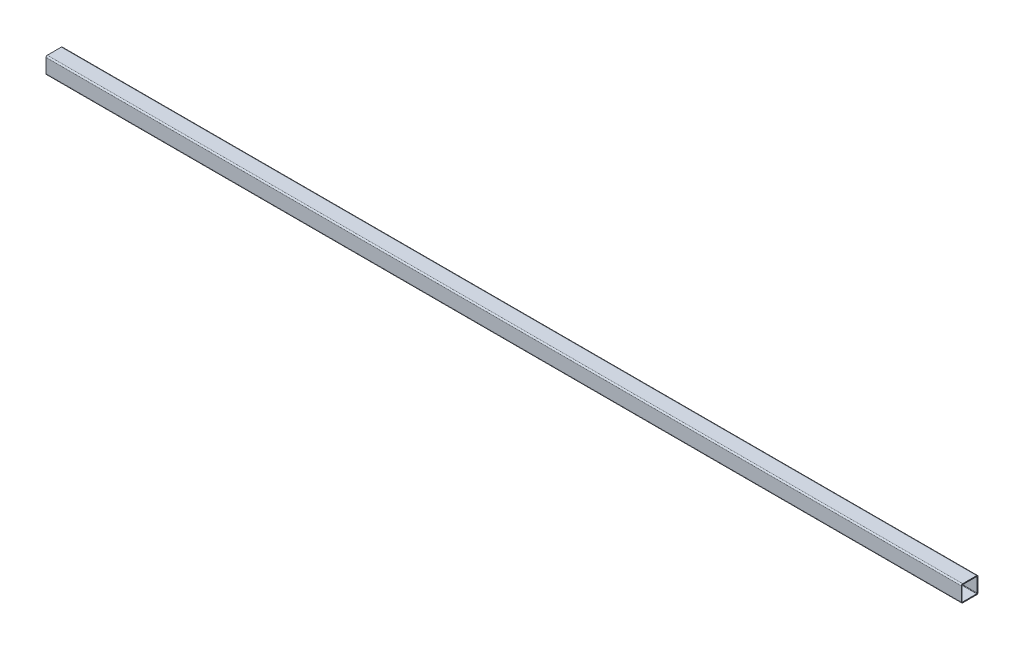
ISO-10303-21;
HEADER;
FILE_DESCRIPTION(('STEP AP214'),'2;1');
FILE_NAME('part.step','',(''),(''),'','','');
FILE_SCHEMA(('AUTOMOTIVE_DESIGN { 1 0 10303 214 1 1 1 1 }'));
ENDSEC;
DATA;
#1=APPLICATION_CONTEXT('core data for automotive mechanical design processes');
#2=APPLICATION_PROTOCOL_DEFINITION('international standard','automotive_design',2000,#1);
#3=PRODUCT_CONTEXT('',#1,'mechanical');
#4=PRODUCT('Part','Part','',(#3));
#5=PRODUCT_RELATED_PRODUCT_CATEGORY('part','',(#4));
#6=PRODUCT_DEFINITION_FORMATION('','',#4);
#7=PRODUCT_DEFINITION_CONTEXT('part definition',#1,'design');
#8=PRODUCT_DEFINITION('design','',#6,#7);
#9=PRODUCT_DEFINITION_SHAPE('','',#8);
#10=(LENGTH_UNIT() NAMED_UNIT(*) SI_UNIT(.MILLI.,.METRE.));
#11=(NAMED_UNIT(*) PLANE_ANGLE_UNIT() SI_UNIT($,.RADIAN.));
#12=(NAMED_UNIT(*) SI_UNIT($,.STERADIAN.) SOLID_ANGLE_UNIT());
#13=UNCERTAINTY_MEASURE_WITH_UNIT(LENGTH_MEASURE(1.E-05),#10,'distance_accuracy_value','');
#14=(GEOMETRIC_REPRESENTATION_CONTEXT(3) GLOBAL_UNCERTAINTY_ASSIGNED_CONTEXT((#13)) GLOBAL_UNIT_ASSIGNED_CONTEXT((#10,
#11,#12)) REPRESENTATION_CONTEXT('',''));
#15=CARTESIAN_POINT('',(0.,0.,0.));
#16=DIRECTION('',(0.,0.,1.));
#17=DIRECTION('',(1.,0.,0.));
#18=AXIS2_PLACEMENT_3D('',#15,#16,#17);
#19=CARTESIAN_POINT('',(698.5,10.541,21.209));
#20=DIRECTION('',(1.,0.,0.));
#21=DIRECTION('',(0.,0.,-1.));
#22=AXIS2_PLACEMENT_3D('',#19,#20,#21);
#23=PLANE('',#22);
#24=CARTESIAN_POINT('',(698.5,10.541,21.209));
#25=DIRECTION('',(1.,0.,0.));
#26=DIRECTION('',(0.,0.,-1.));
#27=AXIS2_PLACEMENT_3D('',#24,#25,#26);
#28=CIRCLE('',#27,1.016);
#29=CARTESIAN_POINT('',(698.5,10.541,22.225));
#30=VERTEX_POINT('',#29);
#31=CARTESIAN_POINT('',(698.5,9.525,21.209));
#32=VERTEX_POINT('',#31);
#33=EDGE_CURVE('E262',#30,#32,#28,.T.);
#34=ORIENTED_EDGE('',*,*,#33,.T.);
#35=DIRECTION('',(0.,0.,-1.));
#36=VECTOR('',#35,1.);
#37=CARTESIAN_POINT('',(698.5,9.525,21.209));
#38=LINE('',#37,#36);
#39=CARTESIAN_POINT('',(698.5,9.525,10.541));
#40=VERTEX_POINT('',#39);
#41=EDGE_CURVE('E476',#32,#40,#38,.T.);
#42=ORIENTED_EDGE('',*,*,#41,.T.);
#43=CARTESIAN_POINT('',(698.5,10.541,10.541));
#44=DIRECTION('',(1.,0.,0.));
#45=DIRECTION('',(0.,0.,-1.));
#46=AXIS2_PLACEMENT_3D('',#43,#44,#45);
#47=CIRCLE('',#46,1.016);
#48=CARTESIAN_POINT('',(698.5,10.541,9.52499999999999));
#49=VERTEX_POINT('',#48);
#50=EDGE_CURVE('E163',#40,#49,#47,.T.);
#51=ORIENTED_EDGE('',*,*,#50,.T.);
#52=DIRECTION('',(0.,1.,0.));
#53=VECTOR('',#52,1.);
#54=CARTESIAN_POINT('',(698.5,10.541,9.52499999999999));
#55=LINE('',#54,#53);
#56=CARTESIAN_POINT('',(698.5,21.209,9.52499999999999));
#57=VERTEX_POINT('',#56);
#58=EDGE_CURVE('E462',#49,#57,#55,.T.);
#59=ORIENTED_EDGE('',*,*,#58,.T.);
#60=CARTESIAN_POINT('',(698.5,21.209,10.541));
#61=DIRECTION('',(1.,0.,0.));
#62=DIRECTION('',(0.,0.,-1.));
#63=AXIS2_PLACEMENT_3D('',#60,#61,#62);
#64=CIRCLE('',#63,1.016);
#65=CARTESIAN_POINT('',(698.5,22.225,10.541));
#66=VERTEX_POINT('',#65);
#67=EDGE_CURVE('E471',#57,#66,#64,.T.);
#68=ORIENTED_EDGE('',*,*,#67,.T.);
#69=DIRECTION('',(0.,0.,1.));
#70=VECTOR('',#69,1.);
#71=CARTESIAN_POINT('',(698.5,22.225,10.541));
#72=LINE('',#71,#70);
#73=CARTESIAN_POINT('',(698.5,22.225,21.209));
#74=VERTEX_POINT('',#73);
#75=EDGE_CURVE('E278',#66,#74,#72,.T.);
#76=ORIENTED_EDGE('',*,*,#75,.T.);
#77=CARTESIAN_POINT('',(698.5,21.209,21.209));
#78=DIRECTION('',(1.,0.,0.));
#79=DIRECTION('',(0.,0.,-1.));
#80=AXIS2_PLACEMENT_3D('',#77,#78,#79);
#81=CIRCLE('',#80,1.01600000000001);
#82=CARTESIAN_POINT('',(698.5,21.209,22.225));
#83=VERTEX_POINT('',#82);
#84=EDGE_CURVE('E295',#74,#83,#81,.T.);
#85=ORIENTED_EDGE('',*,*,#84,.T.);
#86=DIRECTION('',(0.,-1.,0.));
#87=VECTOR('',#86,1.);
#88=CARTESIAN_POINT('',(698.5,21.209,22.225));
#89=LINE('',#88,#87);
#90=EDGE_CURVE('E259',#83,#30,#89,.T.);
#91=ORIENTED_EDGE('',*,*,#90,.T.);
#92=EDGE_LOOP('',(#34,#42,#51,#59,#68,#76,#85,#91));
#93=FACE_BOUND('',#92,.T.);
#94=DIRECTION('',(0.,1.,0.));
#95=VECTOR('',#94,1.);
#96=CARTESIAN_POINT('',(698.5,10.541,10.1854));
#97=LINE('',#96,#95);
#98=CARTESIAN_POINT('',(698.5,10.541,10.1854));
#99=VERTEX_POINT('',#98);
#100=CARTESIAN_POINT('',(698.5,21.209,10.1854));
#101=VERTEX_POINT('',#100);
#102=EDGE_CURVE('E255',#99,#101,#97,.T.);
#103=ORIENTED_EDGE('',*,*,#102,.F.);
#104=CARTESIAN_POINT('',(698.5,10.541,10.541));
#105=DIRECTION('',(1.,0.,0.));
#106=DIRECTION('',(0.,0.,-1.));
#107=AXIS2_PLACEMENT_3D('',#104,#105,#106);
#108=CIRCLE('',#107,0.355599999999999);
#109=CARTESIAN_POINT('',(698.5,10.1854,10.541));
#110=VERTEX_POINT('',#109);
#111=EDGE_CURVE('E102',#110,#99,#108,.T.);
#112=ORIENTED_EDGE('',*,*,#111,.F.);
#113=DIRECTION('',(0.,0.,-1.));
#114=VECTOR('',#113,1.);
#115=CARTESIAN_POINT('',(698.5,10.1854,21.209));
#116=LINE('',#115,#114);
#117=CARTESIAN_POINT('',(698.5,10.1854,21.209));
#118=VERTEX_POINT('',#117);
#119=EDGE_CURVE('E214',#118,#110,#116,.T.);
#120=ORIENTED_EDGE('',*,*,#119,.F.);
#121=CARTESIAN_POINT('',(698.5,10.541,21.209));
#122=DIRECTION('',(1.,0.,0.));
#123=DIRECTION('',(0.,0.,-1.));
#124=AXIS2_PLACEMENT_3D('',#121,#122,#123);
#125=CIRCLE('',#124,0.355599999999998);
#126=CARTESIAN_POINT('',(698.5,10.541,21.5646));
#127=VERTEX_POINT('',#126);
#128=EDGE_CURVE('E245',#127,#118,#125,.T.);
#129=ORIENTED_EDGE('',*,*,#128,.F.);
#130=DIRECTION('',(0.,-1.,0.));
#131=VECTOR('',#130,1.);
#132=CARTESIAN_POINT('',(698.5,21.209,21.5646));
#133=LINE('',#132,#131);
#134=CARTESIAN_POINT('',(698.5,21.209,21.5646));
#135=VERTEX_POINT('',#134);
#136=EDGE_CURVE('E231',#135,#127,#133,.T.);
#137=ORIENTED_EDGE('',*,*,#136,.F.);
#138=CARTESIAN_POINT('',(698.5,21.209,21.209));
#139=DIRECTION('',(1.,5.3297785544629E-13,5.3297785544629E-13));
#140=DIRECTION('',(5.3297785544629E-13,0.,-1.));
#141=AXIS2_PLACEMENT_3D('',#138,#139,#140);
#142=CIRCLE('',#141,0.355600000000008);
#143=CARTESIAN_POINT('',(698.5,21.5646,21.209));
#144=VERTEX_POINT('',#143);
#145=EDGE_CURVE('E240',#144,#135,#142,.T.);
#146=ORIENTED_EDGE('',*,*,#145,.F.);
#147=DIRECTION('',(0.,0.,1.));
#148=VECTOR('',#147,1.);
#149=CARTESIAN_POINT('',(698.5,21.5646,10.541));
#150=LINE('',#149,#148);
#151=CARTESIAN_POINT('',(698.5,21.5646,10.541));
#152=VERTEX_POINT('',#151);
#153=EDGE_CURVE('E248',#152,#144,#150,.T.);
#154=ORIENTED_EDGE('',*,*,#153,.F.);
#155=CARTESIAN_POINT('',(698.5,21.209,10.541));
#156=DIRECTION('',(1.,5.32977855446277E-13,-5.32977855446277E-13));
#157=DIRECTION('',(-5.32977855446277E-13,0.,-1.));
#158=AXIS2_PLACEMENT_3D('',#155,#156,#157);
#159=CIRCLE('',#158,0.355599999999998);
#160=EDGE_CURVE('E253',#101,#152,#159,.T.);
#161=ORIENTED_EDGE('',*,*,#160,.F.);
#162=EDGE_LOOP('',(#103,#112,#120,#129,#137,#146,#154,#161));
#163=FACE_BOUND('',#162,.T.);
#164=ADVANCED_FACE('F43',(#93,#163),#23,.T.);
#165=CARTESIAN_POINT('',(0.,10.541,21.209));
#166=DIRECTION('',(1.,0.,0.));
#167=DIRECTION('',(0.,0.,-1.));
#168=AXIS2_PLACEMENT_3D('',#165,#166,#167);
#169=PLANE('',#168);
#170=CARTESIAN_POINT('',(0.,10.541,21.209));
#171=DIRECTION('',(1.,0.,0.));
#172=DIRECTION('',(0.,0.,-1.));
#173=AXIS2_PLACEMENT_3D('',#170,#171,#172);
#174=CIRCLE('',#173,1.016);
#175=CARTESIAN_POINT('',(0.,10.541,22.225));
#176=VERTEX_POINT('',#175);
#177=CARTESIAN_POINT('',(0.,9.525,21.209));
#178=VERTEX_POINT('',#177);
#179=EDGE_CURVE('E156',#176,#178,#174,.T.);
#180=ORIENTED_EDGE('',*,*,#179,.F.);
#181=DIRECTION('',(0.,-1.,0.));
#182=VECTOR('',#181,1.);
#183=CARTESIAN_POINT('',(0.,21.209,22.225));
#184=LINE('',#183,#182);
#185=CARTESIAN_POINT('',(0.,21.209,22.225));
#186=VERTEX_POINT('',#185);
#187=EDGE_CURVE('E260',#186,#176,#184,.T.);
#188=ORIENTED_EDGE('',*,*,#187,.F.);
#189=CARTESIAN_POINT('',(0.,21.209,21.209));
#190=DIRECTION('',(1.,0.,0.));
#191=DIRECTION('',(0.,0.,-1.));
#192=AXIS2_PLACEMENT_3D('',#189,#190,#191);
#193=CIRCLE('',#192,1.01600000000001);
#194=CARTESIAN_POINT('',(0.,22.225,21.209));
#195=VERTEX_POINT('',#194);
#196=EDGE_CURVE('E263',#195,#186,#193,.T.);
#197=ORIENTED_EDGE('',*,*,#196,.F.);
#198=DIRECTION('',(0.,0.,1.));
#199=VECTOR('',#198,1.);
#200=CARTESIAN_POINT('',(0.,22.225,10.541));
#201=LINE('',#200,#199);
#202=CARTESIAN_POINT('',(0.,22.225,10.541));
#203=VERTEX_POINT('',#202);
#204=EDGE_CURVE('E265',#203,#195,#201,.T.);
#205=ORIENTED_EDGE('',*,*,#204,.F.);
#206=CARTESIAN_POINT('',(0.,21.209,10.541));
#207=DIRECTION('',(1.,0.,0.));
#208=DIRECTION('',(0.,0.,-1.));
#209=AXIS2_PLACEMENT_3D('',#206,#207,#208);
#210=CIRCLE('',#209,1.016);
#211=CARTESIAN_POINT('',(0.,21.209,9.52499999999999));
#212=VERTEX_POINT('',#211);
#213=EDGE_CURVE('E172',#212,#203,#210,.T.);
#214=ORIENTED_EDGE('',*,*,#213,.F.);
#215=DIRECTION('',(0.,1.,0.));
#216=VECTOR('',#215,1.);
#217=CARTESIAN_POINT('',(0.,10.541,9.52499999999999));
#218=LINE('',#217,#216);
#219=CARTESIAN_POINT('',(0.,10.541,9.52499999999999));
#220=VERTEX_POINT('',#219);
#221=EDGE_CURVE('E170',#220,#212,#218,.T.);
#222=ORIENTED_EDGE('',*,*,#221,.F.);
#223=CARTESIAN_POINT('',(0.,10.541,10.541));
#224=DIRECTION('',(1.,0.,0.));
#225=DIRECTION('',(0.,0.,-1.));
#226=AXIS2_PLACEMENT_3D('',#223,#224,#225);
#227=CIRCLE('',#226,1.016);
#228=CARTESIAN_POINT('',(0.,9.525,10.541));
#229=VERTEX_POINT('',#228);
#230=EDGE_CURVE('E155',#229,#220,#227,.T.);
#231=ORIENTED_EDGE('',*,*,#230,.F.);
#232=DIRECTION('',(0.,0.,-1.));
#233=VECTOR('',#232,1.);
#234=CARTESIAN_POINT('',(0.,9.525,21.209));
#235=LINE('',#234,#233);
#236=EDGE_CURVE('E145',#178,#229,#235,.T.);
#237=ORIENTED_EDGE('',*,*,#236,.F.);
#238=EDGE_LOOP('',(#180,#188,#197,#205,#214,#222,#231,#237));
#239=FACE_BOUND('',#238,.T.);
#240=CARTESIAN_POINT('',(0.,10.541,10.541));
#241=DIRECTION('',(1.,0.,0.));
#242=DIRECTION('',(0.,0.,-1.));
#243=AXIS2_PLACEMENT_3D('',#240,#241,#242);
#244=CIRCLE('',#243,0.355599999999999);
#245=CARTESIAN_POINT('',(0.,10.1854,10.541));
#246=VERTEX_POINT('',#245);
#247=CARTESIAN_POINT('',(0.,10.541,10.1854));
#248=VERTEX_POINT('',#247);
#249=EDGE_CURVE('E68',#246,#248,#244,.T.);
#250=ORIENTED_EDGE('',*,*,#249,.T.);
#251=DIRECTION('',(0.,1.,0.));
#252=VECTOR('',#251,1.);
#253=CARTESIAN_POINT('',(0.,10.541,10.1854));
#254=LINE('',#253,#252);
#255=CARTESIAN_POINT('',(0.,21.209,10.1854));
#256=VERTEX_POINT('',#255);
#257=EDGE_CURVE('E177',#248,#256,#254,.T.);
#258=ORIENTED_EDGE('',*,*,#257,.T.);
#259=CARTESIAN_POINT('',(0.,21.209,10.541));
#260=DIRECTION('',(1.,0.,0.));
#261=DIRECTION('',(0.,0.,-1.));
#262=AXIS2_PLACEMENT_3D('',#259,#260,#261);
#263=CIRCLE('',#262,0.355599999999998);
#264=CARTESIAN_POINT('',(0.,21.5646,10.541));
#265=VERTEX_POINT('',#264);
#266=EDGE_CURVE('E180',#256,#265,#263,.T.);
#267=ORIENTED_EDGE('',*,*,#266,.T.);
#268=DIRECTION('',(0.,0.,1.));
#269=VECTOR('',#268,1.);
#270=CARTESIAN_POINT('',(0.,21.5646,10.541));
#271=LINE('',#270,#269);
#272=CARTESIAN_POINT('',(0.,21.5646,21.209));
#273=VERTEX_POINT('',#272);
#274=EDGE_CURVE('E183',#265,#273,#271,.T.);
#275=ORIENTED_EDGE('',*,*,#274,.T.);
#276=CARTESIAN_POINT('',(0.,21.209,21.209));
#277=DIRECTION('',(1.,0.,0.));
#278=DIRECTION('',(0.,0.,-1.));
#279=AXIS2_PLACEMENT_3D('',#276,#277,#278);
#280=CIRCLE('',#279,0.355600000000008);
#281=CARTESIAN_POINT('',(0.,21.209,21.5646));
#282=VERTEX_POINT('',#281);
#283=EDGE_CURVE('E186',#273,#282,#280,.T.);
#284=ORIENTED_EDGE('',*,*,#283,.T.);
#285=DIRECTION('',(0.,-1.,0.));
#286=VECTOR('',#285,1.);
#287=CARTESIAN_POINT('',(0.,21.209,21.5646));
#288=LINE('',#287,#286);
#289=CARTESIAN_POINT('',(0.,10.541,21.5646));
#290=VERTEX_POINT('',#289);
#291=EDGE_CURVE('E189',#282,#290,#288,.T.);
#292=ORIENTED_EDGE('',*,*,#291,.T.);
#293=CARTESIAN_POINT('',(0.,10.541,21.209));
#294=DIRECTION('',(1.,0.,0.));
#295=DIRECTION('',(0.,0.,-1.));
#296=AXIS2_PLACEMENT_3D('',#293,#294,#295);
#297=CIRCLE('',#296,0.355599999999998);
#298=CARTESIAN_POINT('',(0.,10.1854,21.209));
#299=VERTEX_POINT('',#298);
#300=EDGE_CURVE('E192',#290,#299,#297,.T.);
#301=ORIENTED_EDGE('',*,*,#300,.T.);
#302=DIRECTION('',(0.,0.,-1.));
#303=VECTOR('',#302,1.);
#304=CARTESIAN_POINT('',(0.,10.1854,21.209));
#305=LINE('',#304,#303);
#306=EDGE_CURVE('E195',#299,#246,#305,.T.);
#307=ORIENTED_EDGE('',*,*,#306,.T.);
#308=EDGE_LOOP('',(#250,#258,#267,#275,#284,#292,#301,#307));
#309=FACE_BOUND('',#308,.T.);
#310=ADVANCED_FACE('F167',(#239,#309),#169,.F.);
#311=CARTESIAN_POINT('',(698.5,10.541,21.209));
#312=DIRECTION('',(-1.,0.,0.));
#313=DIRECTION('',(0.,0.,1.));
#314=AXIS2_PLACEMENT_3D('',#311,#312,#313);
#315=CYLINDRICAL_SURFACE('',#314,1.016);
#316=ORIENTED_EDGE('',*,*,#179,.T.);
#317=DIRECTION('',(-1.,0.,0.));
#318=VECTOR('',#317,1.);
#319=CARTESIAN_POINT('',(698.5,9.525,21.209));
#320=LINE('',#319,#318);
#321=EDGE_CURVE('E11',#32,#178,#320,.T.);
#322=ORIENTED_EDGE('',*,*,#321,.F.);
#323=ORIENTED_EDGE('',*,*,#33,.F.);
#324=DIRECTION('',(-1.,0.,0.));
#325=VECTOR('',#324,1.);
#326=CARTESIAN_POINT('',(698.5,10.541,22.225));
#327=LINE('',#326,#325);
#328=EDGE_CURVE('E211',#30,#176,#327,.T.);
#329=ORIENTED_EDGE('',*,*,#328,.T.);
#330=EDGE_LOOP('',(#316,#322,#323,#329));
#331=FACE_BOUND('',#330,.T.);
#332=ADVANCED_FACE('F325',(#331),#315,.T.);
#333=CARTESIAN_POINT('',(698.5,9.525,21.209));
#334=DIRECTION('',(0.,1.,0.));
#335=DIRECTION('',(0.,0.,1.));
#336=AXIS2_PLACEMENT_3D('',#333,#334,#335);
#337=PLANE('',#336);
#338=ORIENTED_EDGE('',*,*,#236,.T.);
#339=DIRECTION('',(-1.,0.,0.));
#340=VECTOR('',#339,1.);
#341=CARTESIAN_POINT('',(698.5,9.525,10.541));
#342=LINE('',#341,#340);
#343=EDGE_CURVE('E52',#40,#229,#342,.T.);
#344=ORIENTED_EDGE('',*,*,#343,.F.);
#345=ORIENTED_EDGE('',*,*,#41,.F.);
#346=ORIENTED_EDGE('',*,*,#321,.T.);
#347=EDGE_LOOP('',(#338,#344,#345,#346));
#348=FACE_BOUND('',#347,.T.);
#349=ADVANCED_FACE('F149',(#348),#337,.F.);
#350=CARTESIAN_POINT('',(698.5,10.541,10.541));
#351=DIRECTION('',(-1.,0.,0.));
#352=DIRECTION('',(0.,0.,1.));
#353=AXIS2_PLACEMENT_3D('',#350,#351,#352);
#354=CYLINDRICAL_SURFACE('',#353,1.016);
#355=ORIENTED_EDGE('',*,*,#230,.T.);
#356=DIRECTION('',(-1.,0.,0.));
#357=VECTOR('',#356,1.);
#358=CARTESIAN_POINT('',(698.5,10.541,9.52499999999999));
#359=LINE('',#358,#357);
#360=EDGE_CURVE('E164',#49,#220,#359,.T.);
#361=ORIENTED_EDGE('',*,*,#360,.F.);
#362=ORIENTED_EDGE('',*,*,#50,.F.);
#363=ORIENTED_EDGE('',*,*,#343,.T.);
#364=EDGE_LOOP('',(#355,#361,#362,#363));
#365=FACE_BOUND('',#364,.T.);
#366=ADVANCED_FACE('F159',(#365),#354,.T.);
#367=CARTESIAN_POINT('',(698.5,10.541,9.52499999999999));
#368=DIRECTION('',(0.,0.,1.));
#369=DIRECTION('',(1.,0.,0.));
#370=AXIS2_PLACEMENT_3D('',#367,#368,#369);
#371=PLANE('',#370);
#372=ORIENTED_EDGE('',*,*,#221,.T.);
#373=DIRECTION('',(-1.,0.,0.));
#374=VECTOR('',#373,1.);
#375=CARTESIAN_POINT('',(698.5,21.209,9.52499999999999));
#376=LINE('',#375,#374);
#377=EDGE_CURVE('E199',#57,#212,#376,.T.);
#378=ORIENTED_EDGE('',*,*,#377,.F.);
#379=ORIENTED_EDGE('',*,*,#58,.F.);
#380=ORIENTED_EDGE('',*,*,#360,.T.);
#381=EDGE_LOOP('',(#372,#378,#379,#380));
#382=FACE_BOUND('',#381,.T.);
#383=ADVANCED_FACE('F335',(#382),#371,.F.);
#384=CARTESIAN_POINT('',(698.5,21.209,10.541));
#385=DIRECTION('',(-1.,0.,0.));
#386=DIRECTION('',(0.,0.,1.));
#387=AXIS2_PLACEMENT_3D('',#384,#385,#386);
#388=CYLINDRICAL_SURFACE('',#387,1.016);
#389=ORIENTED_EDGE('',*,*,#213,.T.);
#390=DIRECTION('',(-1.,0.,0.));
#391=VECTOR('',#390,1.);
#392=CARTESIAN_POINT('',(698.5,22.225,10.541));
#393=LINE('',#392,#391);
#394=EDGE_CURVE('E202',#66,#203,#393,.T.);
#395=ORIENTED_EDGE('',*,*,#394,.F.);
#396=ORIENTED_EDGE('',*,*,#67,.F.);
#397=ORIENTED_EDGE('',*,*,#377,.T.);
#398=EDGE_LOOP('',(#389,#395,#396,#397));
#399=FACE_BOUND('',#398,.T.);
#400=ADVANCED_FACE('F268',(#399),#388,.T.);
#401=CARTESIAN_POINT('',(698.5,22.225,10.541));
#402=DIRECTION('',(0.,-1.,0.));
#403=DIRECTION('',(0.,0.,-1.));
#404=AXIS2_PLACEMENT_3D('',#401,#402,#403);
#405=PLANE('',#404);
#406=ORIENTED_EDGE('',*,*,#204,.T.);
#407=DIRECTION('',(-1.,0.,0.));
#408=VECTOR('',#407,1.);
#409=CARTESIAN_POINT('',(698.5,22.225,21.209));
#410=LINE('',#409,#408);
#411=EDGE_CURVE('E205',#74,#195,#410,.T.);
#412=ORIENTED_EDGE('',*,*,#411,.F.);
#413=ORIENTED_EDGE('',*,*,#75,.F.);
#414=ORIENTED_EDGE('',*,*,#394,.T.);
#415=EDGE_LOOP('',(#406,#412,#413,#414));
#416=FACE_BOUND('',#415,.T.);
#417=ADVANCED_FACE('F275',(#416),#405,.F.);
#418=CARTESIAN_POINT('',(698.5,21.209,21.209));
#419=DIRECTION('',(-1.,0.,0.));
#420=DIRECTION('',(0.,0.,1.));
#421=AXIS2_PLACEMENT_3D('',#418,#419,#420);
#422=CYLINDRICAL_SURFACE('',#421,1.016);
#423=ORIENTED_EDGE('',*,*,#196,.T.);
#424=DIRECTION('',(-1.,0.,0.));
#425=VECTOR('',#424,1.);
#426=CARTESIAN_POINT('',(698.5,21.209,22.225));
#427=LINE('',#426,#425);
#428=EDGE_CURVE('E208',#83,#186,#427,.T.);
#429=ORIENTED_EDGE('',*,*,#428,.F.);
#430=ORIENTED_EDGE('',*,*,#84,.F.);
#431=ORIENTED_EDGE('',*,*,#411,.T.);
#432=EDGE_LOOP('',(#423,#429,#430,#431));
#433=FACE_BOUND('',#432,.T.);
#434=ADVANCED_FACE('F283',(#433),#422,.T.);
#435=CARTESIAN_POINT('',(698.5,21.209,22.225));
#436=DIRECTION('',(0.,0.,-1.));
#437=DIRECTION('',(0.,1.,0.));
#438=AXIS2_PLACEMENT_3D('',#435,#436,#437);
#439=PLANE('',#438);
#440=ORIENTED_EDGE('',*,*,#187,.T.);
#441=ORIENTED_EDGE('',*,*,#328,.F.);
#442=ORIENTED_EDGE('',*,*,#90,.F.);
#443=ORIENTED_EDGE('',*,*,#428,.T.);
#444=EDGE_LOOP('',(#440,#441,#442,#443));
#445=FACE_BOUND('',#444,.T.);
#446=ADVANCED_FACE('F287',(#445),#439,.F.);
#447=CARTESIAN_POINT('',(698.5,10.541,10.541));
#448=DIRECTION('',(-1.,0.,0.));
#449=DIRECTION('',(0.,0.,1.));
#450=AXIS2_PLACEMENT_3D('',#447,#448,#449);
#451=CYLINDRICAL_SURFACE('',#450,0.3556);
#452=ORIENTED_EDGE('',*,*,#249,.F.);
#453=DIRECTION('',(-1.,0.,0.));
#454=VECTOR('',#453,1.);
#455=CARTESIAN_POINT('',(698.5,10.1854,10.541));
#456=LINE('',#455,#454);
#457=EDGE_CURVE('E212',#110,#246,#456,.T.);
#458=ORIENTED_EDGE('',*,*,#457,.F.);
#459=ORIENTED_EDGE('',*,*,#111,.T.);
#460=DIRECTION('',(-1.,0.,0.));
#461=VECTOR('',#460,1.);
#462=CARTESIAN_POINT('',(698.5,10.541,10.1854));
#463=LINE('',#462,#461);
#464=EDGE_CURVE('E215',#99,#248,#463,.T.);
#465=ORIENTED_EDGE('',*,*,#464,.T.);
#466=EDGE_LOOP('',(#452,#458,#459,#465));
#467=FACE_BOUND('',#466,.T.);
#468=ADVANCED_FACE('F301',(#467),#451,.F.);
#469=CARTESIAN_POINT('',(698.5,10.541,10.1854));
#470=DIRECTION('',(0.,0.,1.));
#471=DIRECTION('',(1.,0.,0.));
#472=AXIS2_PLACEMENT_3D('',#469,#470,#471);
#473=PLANE('',#472);
#474=ORIENTED_EDGE('',*,*,#257,.F.);
#475=ORIENTED_EDGE('',*,*,#464,.F.);
#476=ORIENTED_EDGE('',*,*,#102,.T.);
#477=DIRECTION('',(-1.,0.,0.));
#478=VECTOR('',#477,1.);
#479=CARTESIAN_POINT('',(698.5,21.209,10.1854));
#480=LINE('',#479,#478);
#481=EDGE_CURVE('E217',#101,#256,#480,.T.);
#482=ORIENTED_EDGE('',*,*,#481,.T.);
#483=EDGE_LOOP('',(#474,#475,#476,#482));
#484=FACE_BOUND('',#483,.T.);
#485=ADVANCED_FACE('F305',(#484),#473,.T.);
#486=CARTESIAN_POINT('',(698.5,21.209,10.541));
#487=DIRECTION('',(-1.,0.,0.));
#488=DIRECTION('',(0.,0.,1.));
#489=AXIS2_PLACEMENT_3D('',#486,#487,#488);
#490=CYLINDRICAL_SURFACE('',#489,0.3556);
#491=ORIENTED_EDGE('',*,*,#266,.F.);
#492=ORIENTED_EDGE('',*,*,#481,.F.);
#493=ORIENTED_EDGE('',*,*,#160,.T.);
#494=DIRECTION('',(-1.,0.,0.));
#495=VECTOR('',#494,1.);
#496=CARTESIAN_POINT('',(698.5,21.5646,10.541));
#497=LINE('',#496,#495);
#498=EDGE_CURVE('E219',#152,#265,#497,.T.);
#499=ORIENTED_EDGE('',*,*,#498,.T.);
#500=EDGE_LOOP('',(#491,#492,#493,#499));
#501=FACE_BOUND('',#500,.T.);
#502=ADVANCED_FACE('F308',(#501),#490,.F.);
#503=CARTESIAN_POINT('',(698.5,21.5646,10.541));
#504=DIRECTION('',(0.,-1.,0.));
#505=DIRECTION('',(0.,0.,-1.));
#506=AXIS2_PLACEMENT_3D('',#503,#504,#505);
#507=PLANE('',#506);
#508=ORIENTED_EDGE('',*,*,#274,.F.);
#509=ORIENTED_EDGE('',*,*,#498,.F.);
#510=ORIENTED_EDGE('',*,*,#153,.T.);
#511=DIRECTION('',(-1.,0.,0.));
#512=VECTOR('',#511,1.);
#513=CARTESIAN_POINT('',(698.5,21.5646,21.209));
#514=LINE('',#513,#512);
#515=EDGE_CURVE('E221',#144,#273,#514,.T.);
#516=ORIENTED_EDGE('',*,*,#515,.T.);
#517=EDGE_LOOP('',(#508,#509,#510,#516));
#518=FACE_BOUND('',#517,.T.);
#519=ADVANCED_FACE('F311',(#518),#507,.T.);
#520=CARTESIAN_POINT('',(698.5,21.209,21.209));
#521=DIRECTION('',(-1.,0.,0.));
#522=DIRECTION('',(0.,0.,1.));
#523=AXIS2_PLACEMENT_3D('',#520,#521,#522);
#524=CYLINDRICAL_SURFACE('',#523,0.355600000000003);
#525=ORIENTED_EDGE('',*,*,#283,.F.);
#526=ORIENTED_EDGE('',*,*,#515,.F.);
#527=ORIENTED_EDGE('',*,*,#145,.T.);
#528=DIRECTION('',(-1.,0.,0.));
#529=VECTOR('',#528,1.);
#530=CARTESIAN_POINT('',(698.5,21.209,21.5646));
#531=LINE('',#530,#529);
#532=EDGE_CURVE('E223',#135,#282,#531,.T.);
#533=ORIENTED_EDGE('',*,*,#532,.T.);
#534=EDGE_LOOP('',(#525,#526,#527,#533));
#535=FACE_BOUND('',#534,.T.);
#536=ADVANCED_FACE('F238',(#535),#524,.F.);
#537=CARTESIAN_POINT('',(698.5,21.209,21.5646));
#538=DIRECTION('',(0.,0.,-1.));
#539=DIRECTION('',(-1.,0.,0.));
#540=AXIS2_PLACEMENT_3D('',#537,#538,#539);
#541=PLANE('',#540);
#542=ORIENTED_EDGE('',*,*,#291,.F.);
#543=ORIENTED_EDGE('',*,*,#532,.F.);
#544=ORIENTED_EDGE('',*,*,#136,.T.);
#545=DIRECTION('',(-1.,0.,0.));
#546=VECTOR('',#545,1.);
#547=CARTESIAN_POINT('',(698.5,10.541,21.5646));
#548=LINE('',#547,#546);
#549=EDGE_CURVE('E224',#127,#290,#548,.T.);
#550=ORIENTED_EDGE('',*,*,#549,.T.);
#551=EDGE_LOOP('',(#542,#543,#544,#550));
#552=FACE_BOUND('',#551,.T.);
#553=ADVANCED_FACE('F228',(#552),#541,.T.);
#554=CARTESIAN_POINT('',(698.5,10.541,21.209));
#555=DIRECTION('',(-1.,0.,0.));
#556=DIRECTION('',(0.,0.,1.));
#557=AXIS2_PLACEMENT_3D('',#554,#555,#556);
#558=CYLINDRICAL_SURFACE('',#557,0.355600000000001);
#559=ORIENTED_EDGE('',*,*,#300,.F.);
#560=ORIENTED_EDGE('',*,*,#549,.F.);
#561=ORIENTED_EDGE('',*,*,#128,.T.);
#562=DIRECTION('',(-1.,0.,0.));
#563=VECTOR('',#562,1.);
#564=CARTESIAN_POINT('',(698.5,10.1854,21.209));
#565=LINE('',#564,#563);
#566=EDGE_CURVE('E47',#118,#299,#565,.T.);
#567=ORIENTED_EDGE('',*,*,#566,.T.);
#568=EDGE_LOOP('',(#559,#560,#561,#567));
#569=FACE_BOUND('',#568,.T.);
#570=ADVANCED_FACE('F233',(#569),#558,.F.);
#571=CARTESIAN_POINT('',(698.5,10.1854,21.209));
#572=DIRECTION('',(0.,1.,0.));
#573=DIRECTION('',(0.,0.,1.));
#574=AXIS2_PLACEMENT_3D('',#571,#572,#573);
#575=PLANE('',#574);
#576=ORIENTED_EDGE('',*,*,#306,.F.);
#577=ORIENTED_EDGE('',*,*,#566,.F.);
#578=ORIENTED_EDGE('',*,*,#119,.T.);
#579=ORIENTED_EDGE('',*,*,#457,.T.);
#580=EDGE_LOOP('',(#576,#577,#578,#579));
#581=FACE_BOUND('',#580,.T.);
#582=ADVANCED_FACE('F45',(#581),#575,.T.);
#583=CLOSED_SHELL('',(#164,#310,#332,#349,#366,#383,#400,#417,#434,#446,#468,#485,#502,#519,
#536,#553,#570,#582));
#584=MANIFOLD_SOLID_BREP('B2',#583);
#585=ADVANCED_BREP_SHAPE_REPRESENTATION('',(#18,#584),#14);
#586=SHAPE_DEFINITION_REPRESENTATION(#9,#585);
ENDSEC;
END-ISO-10303-21;
